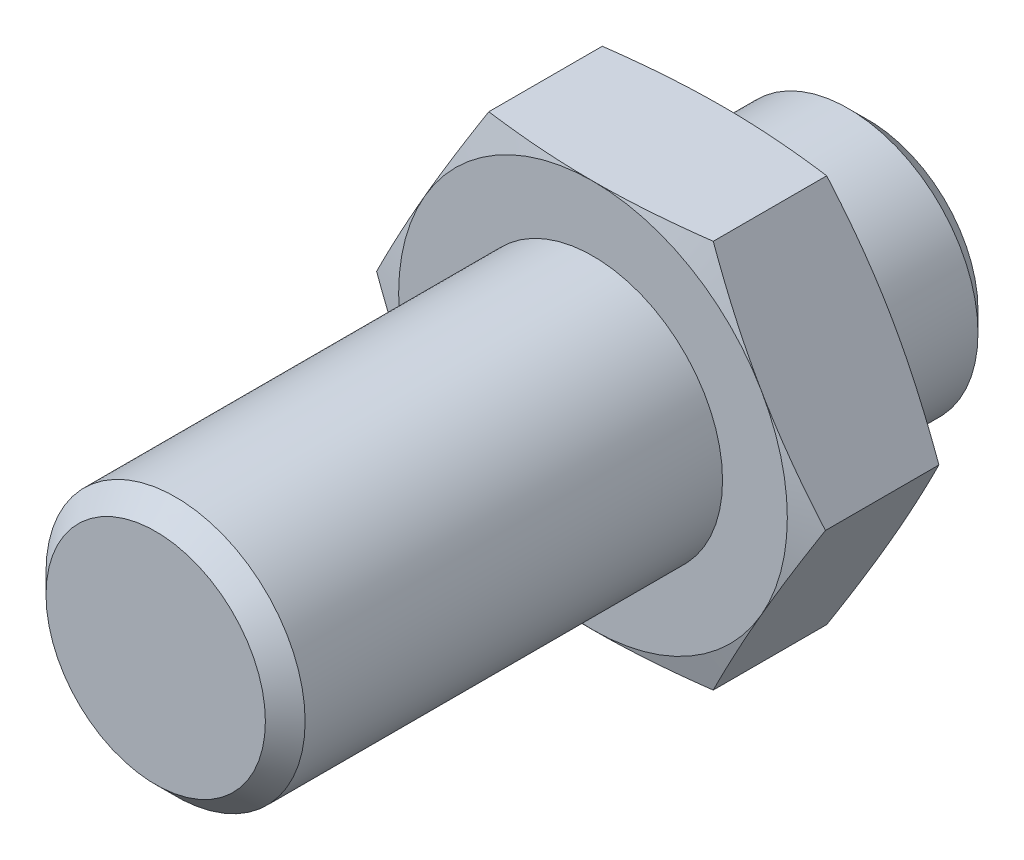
ISO-10303-21;
HEADER;
FILE_DESCRIPTION(('STEP AP214'),'2;1');
FILE_NAME('part.step','',(''),(''),'','','');
FILE_SCHEMA(('AUTOMOTIVE_DESIGN { 1 0 10303 214 1 1 1 1 }'));
ENDSEC;
DATA;
#1=APPLICATION_CONTEXT('core data for automotive mechanical design processes');
#2=APPLICATION_PROTOCOL_DEFINITION('international standard','automotive_design',2000,#1);
#3=PRODUCT_CONTEXT('',#1,'mechanical');
#4=PRODUCT('Part','Part','',(#3));
#5=PRODUCT_RELATED_PRODUCT_CATEGORY('part','',(#4));
#6=PRODUCT_DEFINITION_FORMATION('','',#4);
#7=PRODUCT_DEFINITION_CONTEXT('part definition',#1,'design');
#8=PRODUCT_DEFINITION('design','',#6,#7);
#9=PRODUCT_DEFINITION_SHAPE('','',#8);
#10=(LENGTH_UNIT() NAMED_UNIT(*) SI_UNIT(.MILLI.,.METRE.));
#11=(NAMED_UNIT(*) PLANE_ANGLE_UNIT() SI_UNIT($,.RADIAN.));
#12=(NAMED_UNIT(*) SI_UNIT($,.STERADIAN.) SOLID_ANGLE_UNIT());
#13=UNCERTAINTY_MEASURE_WITH_UNIT(LENGTH_MEASURE(1.E-05),#10,'distance_accuracy_value','');
#14=(GEOMETRIC_REPRESENTATION_CONTEXT(3) GLOBAL_UNCERTAINTY_ASSIGNED_CONTEXT((#13)) GLOBAL_UNIT_ASSIGNED_CONTEXT((#10,
#11,#12)) REPRESENTATION_CONTEXT('',''));
#15=CARTESIAN_POINT('',(0.,0.,0.));
#16=DIRECTION('',(0.,0.,1.));
#17=DIRECTION('',(1.,0.,0.));
#18=AXIS2_PLACEMENT_3D('',#15,#16,#17);
#19=CARTESIAN_POINT('',(0.,3.3865,0.));
#20=DIRECTION('',(0.,0.,1.));
#21=DIRECTION('',(1.,0.,0.));
#22=AXIS2_PLACEMENT_3D('',#19,#20,#21);
#23=PLANE('',#22);
#24=CARTESIAN_POINT('',(0.,0.,0.));
#25=DIRECTION('',(0.,0.,1.));
#26=DIRECTION('',(1.,0.,0.));
#27=AXIS2_PLACEMENT_3D('',#24,#25,#26);
#28=CIRCLE('',#27,3.38650000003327);
#29=CARTESIAN_POINT('',(3.38650000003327,0.,0.));
#30=VERTEX_POINT('',#29);
#31=EDGE_CURVE('E20',#30,#30,#28,.T.);
#32=ORIENTED_EDGE('',*,*,#31,.F.);
#33=EDGE_LOOP('',(#32));
#34=FACE_BOUND('',#33,.T.);
#35=ADVANCED_FACE('F17',(#34),#23,.F.);
#36=CARTESIAN_POINT('',(0.,0.,0.613499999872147));
#37=DIRECTION('',(0.,0.,1.));
#38=DIRECTION('',(1.,0.,0.));
#39=AXIS2_PLACEMENT_3D('',#36,#37,#38);
#40=CONICAL_SURFACE('',#39,3.99999999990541,0.785398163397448);
#41=CARTESIAN_POINT('',(0.,0.,0.613500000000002));
#42=DIRECTION('',(0.,0.,1.));
#43=DIRECTION('',(1.,0.,0.));
#44=AXIS2_PLACEMENT_3D('',#41,#42,#43);
#45=CIRCLE('',#44,4.);
#46=CARTESIAN_POINT('',(4.,0.,0.613500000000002));
#47=VERTEX_POINT('',#46);
#48=EDGE_CURVE('E371',#47,#47,#45,.T.);
#49=ORIENTED_EDGE('',*,*,#48,.F.);
#50=EDGE_LOOP('',(#49));
#51=FACE_BOUND('',#50,.T.);
#52=ORIENTED_EDGE('',*,*,#31,.T.);
#53=EDGE_LOOP('',(#52));
#54=FACE_BOUND('',#53,.T.);
#55=ADVANCED_FACE('F408',(#51,#54),#40,.T.);
#56=CARTESIAN_POINT('',(0.,0.,0.));
#57=DIRECTION('',(0.,0.,1.));
#58=DIRECTION('',(1.,0.,0.));
#59=AXIS2_PLACEMENT_3D('',#56,#57,#58);
#60=CYLINDRICAL_SURFACE('',#59,4.);
#61=CARTESIAN_POINT('',(0.,0.,4.5));
#62=DIRECTION('',(0.,0.,1.));
#63=DIRECTION('',(1.,0.,0.));
#64=AXIS2_PLACEMENT_3D('',#61,#62,#63);
#65=CIRCLE('',#64,4.);
#66=CARTESIAN_POINT('',(4.,0.,4.5));
#67=VERTEX_POINT('',#66);
#68=EDGE_CURVE('E125',#67,#67,#65,.F.);
#69=ORIENTED_EDGE('',*,*,#68,.T.);
#70=EDGE_LOOP('',(#69));
#71=FACE_BOUND('',#70,.T.);
#72=ORIENTED_EDGE('',*,*,#48,.T.);
#73=EDGE_LOOP('',(#72));
#74=FACE_BOUND('',#73,.T.);
#75=ADVANCED_FACE('F400',(#71,#74),#60,.T.);
#76=CARTESIAN_POINT('',(0.,4.,4.5));
#77=DIRECTION('',(0.,0.,1.));
#78=DIRECTION('',(1.,0.,0.));
#79=AXIS2_PLACEMENT_3D('',#76,#77,#78);
#80=PLANE('',#79);
#81=ORIENTED_EDGE('',*,*,#68,.F.);
#82=EDGE_LOOP('',(#81));
#83=FACE_BOUND('',#82,.T.);
#84=CARTESIAN_POINT('',(0.,0.,4.50000000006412));
#85=DIRECTION('',(0.,0.,1.));
#86=DIRECTION('',(1.,0.,0.));
#87=AXIS2_PLACEMENT_3D('',#84,#85,#86);
#88=CIRCLE('',#87,6.00000000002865);
#89=CARTESIAN_POINT('',(5.19615242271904,-3.00000000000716,4.50000000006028));
#90=VERTEX_POINT('',#89);
#91=CARTESIAN_POINT('',(5.19615242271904,3.00000000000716,4.50000000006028));
#92=VERTEX_POINT('',#91);
#93=EDGE_CURVE('E106',#90,#92,#88,.T.);
#94=ORIENTED_EDGE('',*,*,#93,.F.);
#95=CARTESIAN_POINT('',(0.,0.,4.50000000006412));
#96=DIRECTION('',(0.,0.,1.));
#97=DIRECTION('',(1.,0.,0.));
#98=AXIS2_PLACEMENT_3D('',#95,#96,#97);
#99=CIRCLE('',#98,6.00000000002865);
#100=CARTESIAN_POINT('',(0.,-6.00000000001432,4.50000000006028));
#101=VERTEX_POINT('',#100);
#102=EDGE_CURVE('E103',#101,#90,#99,.T.);
#103=ORIENTED_EDGE('',*,*,#102,.F.);
#104=CARTESIAN_POINT('',(0.,0.,4.50000000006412));
#105=DIRECTION('',(0.,0.,1.));
#106=DIRECTION('',(1.,0.,0.));
#107=AXIS2_PLACEMENT_3D('',#104,#105,#106);
#108=CIRCLE('',#107,6.00000000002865);
#109=CARTESIAN_POINT('',(-5.19615242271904,-3.00000000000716,4.50000000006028));
#110=VERTEX_POINT('',#109);
#111=EDGE_CURVE('E124',#110,#101,#108,.T.);
#112=ORIENTED_EDGE('',*,*,#111,.F.);
#113=CARTESIAN_POINT('',(0.,0.,4.50000000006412));
#114=DIRECTION('',(0.,0.,1.));
#115=DIRECTION('',(1.,0.,0.));
#116=AXIS2_PLACEMENT_3D('',#113,#114,#115);
#117=CIRCLE('',#116,6.00000000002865);
#118=CARTESIAN_POINT('',(-5.19615242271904,3.00000000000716,4.50000000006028));
#119=VERTEX_POINT('',#118);
#120=EDGE_CURVE('E393',#119,#110,#117,.T.);
#121=ORIENTED_EDGE('',*,*,#120,.F.);
#122=CARTESIAN_POINT('',(0.,0.,4.50000000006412));
#123=DIRECTION('',(0.,0.,1.));
#124=DIRECTION('',(1.,0.,0.));
#125=AXIS2_PLACEMENT_3D('',#122,#123,#124);
#126=CIRCLE('',#125,6.00000000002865);
#127=CARTESIAN_POINT('',(0.,6.00000000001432,4.50000000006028));
#128=VERTEX_POINT('',#127);
#129=EDGE_CURVE('E113',#128,#119,#126,.T.);
#130=ORIENTED_EDGE('',*,*,#129,.F.);
#131=CARTESIAN_POINT('',(0.,0.,4.50000000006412));
#132=DIRECTION('',(0.,0.,1.));
#133=DIRECTION('',(1.,0.,0.));
#134=AXIS2_PLACEMENT_3D('',#131,#132,#133);
#135=CIRCLE('',#134,6.00000000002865);
#136=EDGE_CURVE('E109',#92,#128,#135,.T.);
#137=ORIENTED_EDGE('',*,*,#136,.F.);
#138=EDGE_LOOP('',(#94,#103,#112,#121,#130,#137));
#139=FACE_BOUND('',#138,.T.);
#140=ADVANCED_FACE('F107',(#83,#139),#80,.F.);
#141=CARTESIAN_POINT('',(0.,0.,4.75020357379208));
#142=DIRECTION('',(0.,0.,1.));
#143=DIRECTION('',(1.,0.,0.));
#144=AXIS2_PLACEMENT_3D('',#141,#142,#143);
#145=CONICAL_SURFACE('',#144,6.93377244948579,1.30899693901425);
#146=CARTESIAN_POINT('',(0.,-6.,4.50000000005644));
#147=CARTESIAN_POINT('',(0.144925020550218,-6.,4.49999340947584));
#148=CARTESIAN_POINT('',(0.289845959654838,-6.,4.50140757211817));
#149=CARTESIAN_POINT('',(0.579629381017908,-6.,4.5070216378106));
#150=CARTESIAN_POINT('',(0.724491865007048,-6.,4.51122145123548));
#151=CARTESIAN_POINT('',(1.15859244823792,-6.,4.52790288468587));
#152=CARTESIAN_POINT('',(1.44768188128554,-6.,4.54446674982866));
#153=CARTESIAN_POINT('',(2.02502964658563,-6.,4.58746786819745));
#154=CARTESIAN_POINT('',(2.31328815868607,-6.,4.61390279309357));
#155=CARTESIAN_POINT('',(2.88923748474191,-6.,4.67527616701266));
#156=CARTESIAN_POINT('',(3.17692727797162,-6.,4.71022426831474));
#157=CARTESIAN_POINT('',(3.46410161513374,-6.,4.74871130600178));
#158=B_SPLINE_CURVE_WITH_KNOTS('',3,(#146,#147,#148,#149,#150,#151,#152,#153,#154,#155,#156,
#157),.UNSPECIFIED.,.F.,.F.,(4,2,2,2,2,4),(0.,0.434760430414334,0.869506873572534,
1.73798582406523,2.6062600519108,3.47552335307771),.UNSPECIFIED.);
#159=CARTESIAN_POINT('',(3.464101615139,-5.99999999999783,4.74871130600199));
#160=VERTEX_POINT('',#159);
#161=EDGE_CURVE('E122',#101,#160,#158,.T.);
#162=ORIENTED_EDGE('',*,*,#161,.F.);
#163=ORIENTED_EDGE('',*,*,#102,.T.);
#164=CARTESIAN_POINT('',(3.46410161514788,-6.00000000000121,4.74871130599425));
#165=CARTESIAN_POINT('',(3.60768878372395,-5.75129972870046,4.71022426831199));
#166=CARTESIAN_POINT('',(3.75153368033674,-5.5021530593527,4.67527616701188));
#167=CARTESIAN_POINT('',(4.03950834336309,-5.00336631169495,4.61390279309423));
#168=CARTESIAN_POINT('',(4.1836375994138,-4.75372711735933,4.5874678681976));
#169=CARTESIAN_POINT('',(4.47231148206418,-4.25372928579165,4.54446674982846));
#170=CARTESIAN_POINT('',(4.61685619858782,-4.00337049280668,4.52790288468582));
#171=CARTESIAN_POINT('',(4.83390649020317,-3.62742835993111,4.51122145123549));
#172=CARTESIAN_POINT('',(4.90633773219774,-3.50197376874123,4.5070216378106));
#173=CARTESIAN_POINT('',(5.05122944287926,-3.25101396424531,4.50140757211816));
#174=CARTESIAN_POINT('',(5.12368991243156,-3.12550874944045,4.49999340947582));
#175=CARTESIAN_POINT('',(5.19615242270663,-3.,4.50000000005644));
#176=B_SPLINE_CURVE_WITH_KNOTS('',3,(#164,#165,#166,#167,#168,#169,#170,#171,#172,#173,#174,
#175),.UNSPECIFIED.,.F.,.F.,(4,2,2,2,2,4),(0.,0.869263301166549,1.73753752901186,
2.60601647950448,3.04076292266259,3.47552335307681),.UNSPECIFIED.);
#177=EDGE_CURVE('E119',#160,#90,#176,.T.);
#178=ORIENTED_EDGE('',*,*,#177,.F.);
#179=EDGE_LOOP('',(#162,#163,#178));
#180=FACE_BOUND('',#179,.T.);
#181=ADVANCED_FACE('F117',(#180),#145,.T.);
#182=CARTESIAN_POINT('',(0.,0.,4.75020357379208));
#183=DIRECTION('',(0.,0.,1.));
#184=DIRECTION('',(1.,0.,0.));
#185=AXIS2_PLACEMENT_3D('',#182,#183,#184);
#186=CONICAL_SURFACE('',#185,6.93377244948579,1.30899693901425);
#187=CARTESIAN_POINT('',(-5.19615242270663,-3.,4.50000000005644));
#188=CARTESIAN_POINT('',(-5.12368991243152,-3.12550874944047,4.49999340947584));
#189=CARTESIAN_POINT('',(-5.05122944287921,-3.25101396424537,4.50140757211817));
#190=CARTESIAN_POINT('',(-4.90633773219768,-3.50197376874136,4.5070216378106));
#191=CARTESIAN_POINT('',(-4.83390649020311,-3.62742835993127,4.51122145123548));
#192=CARTESIAN_POINT('',(-4.61685619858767,-4.00337049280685,4.52790288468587));
#193=CARTESIAN_POINT('',(-4.47231148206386,-4.25372928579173,4.54446674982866));
#194=CARTESIAN_POINT('',(-4.18363759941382,-4.75372711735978,4.58746786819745));
#195=CARTESIAN_POINT('',(-4.03950834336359,-5.00336631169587,4.61390279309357));
#196=CARTESIAN_POINT('',(-3.75153368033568,-5.50215305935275,4.67527616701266));
#197=CARTESIAN_POINT('',(-3.60768878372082,-5.75129972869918,4.71022426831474));
#198=CARTESIAN_POINT('',(-3.46410161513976,-5.99999999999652,4.74871130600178));
#199=B_SPLINE_CURVE_WITH_KNOTS('',3,(#187,#188,#189,#190,#191,#192,#193,#194,#195,#196,#197,
#198),.UNSPECIFIED.,.F.,.F.,(4,2,2,2,2,4),(0.,0.434760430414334,0.869506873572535,
1.73798582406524,2.60626005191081,3.47552335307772),.UNSPECIFIED.);
#200=CARTESIAN_POINT('',(-3.46410161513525,-6.,4.74871130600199));
#201=VERTEX_POINT('',#200);
#202=EDGE_CURVE('E378',#110,#201,#199,.T.);
#203=ORIENTED_EDGE('',*,*,#202,.F.);
#204=ORIENTED_EDGE('',*,*,#111,.T.);
#205=CARTESIAN_POINT('',(-3.46410161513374,-6.00000000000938,4.74871130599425));
#206=CARTESIAN_POINT('',(-3.17692727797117,-6.00000000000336,4.71022426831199));
#207=CARTESIAN_POINT('',(-2.88923748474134,-6.0000000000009,4.67527616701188));
#208=CARTESIAN_POINT('',(-2.31328815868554,-5.9999999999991,4.61390279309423));
#209=CARTESIAN_POINT('',(-2.02502964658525,-5.99999999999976,4.5874678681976));
#210=CARTESIAN_POINT('',(-1.44768188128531,-6.00000000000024,4.54446674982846));
#211=CARTESIAN_POINT('',(-1.1585924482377,-6.00000000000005,4.52790288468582));
#212=CARTESIAN_POINT('',(-0.724491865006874,-5.99999999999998,4.51122145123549));
#213=CARTESIAN_POINT('',(-0.579629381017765,-5.99999999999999,4.5070216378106));
#214=CARTESIAN_POINT('',(-0.289845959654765,-6.00000000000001,4.50140757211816));
#215=CARTESIAN_POINT('',(-0.144925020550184,-6.00000000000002,4.49999340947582));
#216=CARTESIAN_POINT('',(0.,-6.,4.50000000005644));
#217=B_SPLINE_CURVE_WITH_KNOTS('',3,(#205,#206,#207,#208,#209,#210,#211,#212,#213,#214,#215,
#216),.UNSPECIFIED.,.F.,.F.,(4,2,2,2,2,4),(0.,0.869263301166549,1.73753752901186,
2.60601647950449,3.0407629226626,3.47552335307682),.UNSPECIFIED.);
#218=EDGE_CURVE('E134',#201,#101,#217,.T.);
#219=ORIENTED_EDGE('',*,*,#218,.F.);
#220=EDGE_LOOP('',(#203,#204,#219));
#221=FACE_BOUND('',#220,.T.);
#222=ADVANCED_FACE('F158',(#221),#186,.T.);
#223=CARTESIAN_POINT('',(0.,0.,4.75020357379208));
#224=DIRECTION('',(0.,0.,1.));
#225=DIRECTION('',(1.,0.,0.));
#226=AXIS2_PLACEMENT_3D('',#223,#224,#225);
#227=CONICAL_SURFACE('',#226,6.93377244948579,1.30899693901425);
#228=ORIENTED_EDGE('',*,*,#120,.T.);
#229=CARTESIAN_POINT('',(-6.92820323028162,-8.16341725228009E-12,4.74871130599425));
#230=CARTESIAN_POINT('',(-6.78461606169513,-0.248700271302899,4.71022426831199));
#231=CARTESIAN_POINT('',(-6.64077116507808,-0.497846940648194,4.67527616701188));
#232=CARTESIAN_POINT('',(-6.35279650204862,-0.996633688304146,4.61390279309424));
#233=CARTESIAN_POINT('',(-6.20866724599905,-1.24627288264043,4.5874678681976));
#234=CARTESIAN_POINT('',(-5.91999336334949,-1.74627071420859,4.54446674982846));
#235=CARTESIAN_POINT('',(-5.77544864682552,-1.99662950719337,4.52790288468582));
#236=CARTESIAN_POINT('',(-5.55839835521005,-2.37257164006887,4.51122145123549));
#237=CARTESIAN_POINT('',(-5.48596711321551,-2.49802623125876,4.5070216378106));
#238=CARTESIAN_POINT('',(-5.34107540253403,-2.7489860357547,4.50140757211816));
#239=CARTESIAN_POINT('',(-5.26861493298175,-2.87449125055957,4.49999340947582));
#240=CARTESIAN_POINT('',(-5.19615242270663,-3.,4.50000000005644));
#241=B_SPLINE_CURVE_WITH_KNOTS('',3,(#229,#230,#231,#232,#233,#234,#235,#236,#237,#238,#239,
#240),.UNSPECIFIED.,.F.,.F.,(4,2,2,2,2,4),(0.,0.869263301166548,1.73753752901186,
2.60601647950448,3.04076292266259,3.47552335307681),.UNSPECIFIED.);
#242=CARTESIAN_POINT('',(-6.92820323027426,-2.16671186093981E-12,4.74871130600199));
#243=VERTEX_POINT('',#242);
#244=EDGE_CURVE('E168',#243,#110,#241,.T.);
#245=ORIENTED_EDGE('',*,*,#244,.F.);
#246=CARTESIAN_POINT('',(-5.19615242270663,3.,4.50000000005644));
#247=CARTESIAN_POINT('',(-5.26861493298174,2.87449125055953,4.49999340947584));
#248=CARTESIAN_POINT('',(-5.34107540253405,2.74898603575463,4.50140757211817));
#249=CARTESIAN_POINT('',(-5.48596711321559,2.49802623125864,4.5070216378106));
#250=CARTESIAN_POINT('',(-5.55839835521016,2.37257164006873,4.51122145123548));
#251=CARTESIAN_POINT('',(-5.77544864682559,1.99662950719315,4.52790288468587));
#252=CARTESIAN_POINT('',(-5.9199933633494,1.74627071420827,4.54446674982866));
#253=CARTESIAN_POINT('',(-6.20866724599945,1.24627288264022,4.58746786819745));
#254=CARTESIAN_POINT('',(-6.35279650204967,0.996633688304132,4.61390279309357));
#255=CARTESIAN_POINT('',(-6.64077116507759,0.497846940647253,4.67527616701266));
#256=CARTESIAN_POINT('',(-6.78461606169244,0.248700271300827,4.71022426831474));
#257=CARTESIAN_POINT('',(-6.9282032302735,3.47812675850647E-12,4.74871130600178));
#258=B_SPLINE_CURVE_WITH_KNOTS('',3,(#246,#247,#248,#249,#250,#251,#252,#253,#254,#255,#256,
#257),.UNSPECIFIED.,.F.,.F.,(4,2,2,2,2,4),(0.,0.434760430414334,0.869506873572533,
1.73798582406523,2.6062600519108,3.47552335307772),.UNSPECIFIED.);
#259=EDGE_CURVE('E267',#119,#243,#258,.T.);
#260=ORIENTED_EDGE('',*,*,#259,.F.);
#261=EDGE_LOOP('',(#228,#245,#260));
#262=FACE_BOUND('',#261,.T.);
#263=ADVANCED_FACE('F501',(#262),#227,.T.);
#264=CARTESIAN_POINT('',(0.,0.,4.75020357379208));
#265=DIRECTION('',(0.,0.,1.));
#266=DIRECTION('',(1.,0.,0.));
#267=AXIS2_PLACEMENT_3D('',#264,#265,#266);
#268=CONICAL_SURFACE('',#267,6.93377244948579,1.30899693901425);
#269=ORIENTED_EDGE('',*,*,#129,.T.);
#270=CARTESIAN_POINT('',(-3.46410161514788,6.00000000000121,4.74871130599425));
#271=CARTESIAN_POINT('',(-3.60768878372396,5.75129972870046,4.71022426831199));
#272=CARTESIAN_POINT('',(-3.75153368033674,5.5021530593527,4.67527616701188));
#273=CARTESIAN_POINT('',(-4.03950834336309,5.00336631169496,4.61390279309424));
#274=CARTESIAN_POINT('',(-4.1836375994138,4.75372711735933,4.5874678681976));
#275=CARTESIAN_POINT('',(-4.47231148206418,4.25372928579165,4.54446674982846));
#276=CARTESIAN_POINT('',(-4.61685619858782,4.00337049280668,4.52790288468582));
#277=CARTESIAN_POINT('',(-4.83390649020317,3.62742835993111,4.51122145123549));
#278=CARTESIAN_POINT('',(-4.90633773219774,3.50197376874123,4.5070216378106));
#279=CARTESIAN_POINT('',(-5.05122944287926,3.25101396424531,4.50140757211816));
#280=CARTESIAN_POINT('',(-5.12368991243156,3.12550874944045,4.49999340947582));
#281=CARTESIAN_POINT('',(-5.19615242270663,3.,4.50000000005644));
#282=B_SPLINE_CURVE_WITH_KNOTS('',3,(#270,#271,#272,#273,#274,#275,#276,#277,#278,#279,#280,
#281),.UNSPECIFIED.,.F.,.F.,(4,2,2,2,2,4),(0.,0.869263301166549,1.73753752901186,
2.60601647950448,3.04076292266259,3.47552335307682),.UNSPECIFIED.);
#283=CARTESIAN_POINT('',(-3.464101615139,5.99999999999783,4.74871130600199));
#284=VERTEX_POINT('',#283);
#285=EDGE_CURVE('E377',#284,#119,#282,.T.);
#286=ORIENTED_EDGE('',*,*,#285,.F.);
#287=CARTESIAN_POINT('',(0.,6.,4.50000000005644));
#288=CARTESIAN_POINT('',(-0.144925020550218,6.,4.49999340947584));
#289=CARTESIAN_POINT('',(-0.289845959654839,6.,4.50140757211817));
#290=CARTESIAN_POINT('',(-0.579629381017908,6.,4.5070216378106));
#291=CARTESIAN_POINT('',(-0.724491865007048,6.,4.51122145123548));
#292=CARTESIAN_POINT('',(-1.15859244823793,6.,4.52790288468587));
#293=CARTESIAN_POINT('',(-1.44768188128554,6.,4.54446674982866));
#294=CARTESIAN_POINT('',(-2.02502964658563,6.,4.58746786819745));
#295=CARTESIAN_POINT('',(-2.31328815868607,6.,4.61390279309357));
#296=CARTESIAN_POINT('',(-2.88923748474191,6.,4.67527616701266));
#297=CARTESIAN_POINT('',(-3.17692727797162,6.,4.71022426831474));
#298=CARTESIAN_POINT('',(-3.46410161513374,6.,4.74871130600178));
#299=B_SPLINE_CURVE_WITH_KNOTS('',3,(#287,#288,#289,#290,#291,#292,#293,#294,#295,#296,#297,
#298),.UNSPECIFIED.,.F.,.F.,(4,2,2,2,2,4),(0.,0.434760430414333,0.869506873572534,
1.73798582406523,2.6062600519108,3.47552335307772),.UNSPECIFIED.);
#300=EDGE_CURVE('E262',#128,#284,#299,.T.);
#301=ORIENTED_EDGE('',*,*,#300,.F.);
#302=EDGE_LOOP('',(#269,#286,#301));
#303=FACE_BOUND('',#302,.T.);
#304=ADVANCED_FACE('F495',(#303),#268,.T.);
#305=CARTESIAN_POINT('',(0.,0.,4.75020357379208));
#306=DIRECTION('',(0.,0.,1.));
#307=DIRECTION('',(1.,0.,0.));
#308=AXIS2_PLACEMENT_3D('',#305,#306,#307);
#309=CONICAL_SURFACE('',#308,6.93377244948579,1.30899693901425);
#310=ORIENTED_EDGE('',*,*,#93,.T.);
#311=CARTESIAN_POINT('',(6.92820323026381,1.27161662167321E-11,4.74871130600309));
#312=CARTESIAN_POINT('',(6.78461606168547,0.248700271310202,4.71022426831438));
#313=CARTESIAN_POINT('',(6.64077116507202,0.497846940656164,4.67527616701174));
#314=CARTESIAN_POINT('',(6.35279650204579,0.996633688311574,4.61390279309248));
#315=CARTESIAN_POINT('',(6.20866724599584,1.24627288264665,4.58746786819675));
#316=CARTESIAN_POINT('',(5.91999336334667,1.74627071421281,4.54446674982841));
#317=CARTESIAN_POINT('',(5.77544864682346,1.9966295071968,4.52790288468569));
#318=CARTESIAN_POINT('',(5.55839835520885,2.37257164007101,4.51122145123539));
#319=CARTESIAN_POINT('',(5.48596711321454,2.49802623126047,4.50702163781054));
#320=CARTESIAN_POINT('',(5.34107540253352,2.74898603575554,4.50140757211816));
#321=CARTESIAN_POINT('',(5.26861493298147,2.87449125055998,4.49999340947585));
#322=CARTESIAN_POINT('',(5.19615242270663,3.,4.50000000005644));
#323=B_SPLINE_CURVE_WITH_KNOTS('',3,(#311,#312,#313,#314,#315,#316,#317,#318,#319,#320,#321,
#322),.UNSPECIFIED.,.F.,.F.,(4,2,2,2,2,4),(0.,0.869263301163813,1.73753752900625,
2.60601647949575,3.04076292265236,3.47552335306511),.UNSPECIFIED.);
#324=CARTESIAN_POINT('',(6.92820323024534,0.,4.74871130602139));
#325=VERTEX_POINT('',#324);
#326=EDGE_CURVE('E131',#325,#92,#323,.T.);
#327=ORIENTED_EDGE('',*,*,#326,.F.);
#328=CARTESIAN_POINT('',(5.19615242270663,-3.,4.50000000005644));
#329=CARTESIAN_POINT('',(5.26861493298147,-2.87449125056,4.49999340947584));
#330=CARTESIAN_POINT('',(5.34107540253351,-2.74898603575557,4.50140757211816));
#331=CARTESIAN_POINT('',(5.4859671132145,-2.49802623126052,4.50702163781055));
#332=CARTESIAN_POINT('',(5.5583983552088,-2.37257164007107,4.51122145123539));
#333=CARTESIAN_POINT('',(5.77544864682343,-1.99662950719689,4.52790288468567));
#334=CARTESIAN_POINT('',(5.91999336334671,-1.74627071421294,4.54446674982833));
#335=CARTESIAN_POINT('',(6.20866724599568,-1.24627288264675,4.58746786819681));
#336=CARTESIAN_POINT('',(6.35279650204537,-0.996633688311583,4.61390279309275));
#337=CARTESIAN_POINT('',(6.64077116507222,-0.497846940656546,4.67527616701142));
#338=CARTESIAN_POINT('',(6.78461606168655,-0.248700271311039,4.71022426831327));
#339=CARTESIAN_POINT('',(6.92820323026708,-1.46054919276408E-11,4.74871130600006));
#340=B_SPLINE_CURVE_WITH_KNOTS('',3,(#328,#329,#330,#331,#332,#333,#334,#335,#336,#337,#338,
#339),.UNSPECIFIED.,.F.,.F.,(4,2,2,2,2,4),(0.,0.43476043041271,0.869506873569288,
1.73798582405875,2.60626005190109,3.47552335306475),.UNSPECIFIED.);
#341=EDGE_CURVE('E128',#90,#325,#340,.T.);
#342=ORIENTED_EDGE('',*,*,#341,.F.);
#343=EDGE_LOOP('',(#310,#327,#342));
#344=FACE_BOUND('',#343,.T.);
#345=ADVANCED_FACE('F129',(#344),#309,.T.);
#346=CARTESIAN_POINT('',(0.,0.,4.75020357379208));
#347=DIRECTION('',(0.,0.,1.));
#348=DIRECTION('',(1.,0.,0.));
#349=AXIS2_PLACEMENT_3D('',#346,#347,#348);
#350=CONICAL_SURFACE('',#349,6.93377244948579,1.30899693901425);
#351=ORIENTED_EDGE('',*,*,#136,.T.);
#352=CARTESIAN_POINT('',(3.46410161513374,6.00000000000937,4.74871130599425));
#353=CARTESIAN_POINT('',(3.17692727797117,6.00000000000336,4.71022426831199));
#354=CARTESIAN_POINT('',(2.88923748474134,6.0000000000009,4.67527616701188));
#355=CARTESIAN_POINT('',(2.31328815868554,5.9999999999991,4.61390279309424));
#356=CARTESIAN_POINT('',(2.02502964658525,5.99999999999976,4.5874678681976));
#357=CARTESIAN_POINT('',(1.44768188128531,6.00000000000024,4.54446674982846));
#358=CARTESIAN_POINT('',(1.1585924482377,6.00000000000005,4.52790288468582));
#359=CARTESIAN_POINT('',(0.724491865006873,5.99999999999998,4.51122145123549));
#360=CARTESIAN_POINT('',(0.579629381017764,5.99999999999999,4.5070216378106));
#361=CARTESIAN_POINT('',(0.289845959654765,6.00000000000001,4.50140757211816));
#362=CARTESIAN_POINT('',(0.144925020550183,6.00000000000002,4.49999340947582));
#363=CARTESIAN_POINT('',(0.,6.,4.50000000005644));
#364=B_SPLINE_CURVE_WITH_KNOTS('',3,(#352,#353,#354,#355,#356,#357,#358,#359,#360,#361,#362,
#363),.UNSPECIFIED.,.F.,.F.,(4,2,2,2,2,4),(0.,0.869263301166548,1.73753752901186,
2.60601647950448,3.0407629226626,3.47552335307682),.UNSPECIFIED.);
#365=CARTESIAN_POINT('',(3.46410161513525,6.,4.74871130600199));
#366=VERTEX_POINT('',#365);
#367=EDGE_CURVE('E256',#366,#128,#364,.T.);
#368=ORIENTED_EDGE('',*,*,#367,.F.);
#369=CARTESIAN_POINT('',(5.19615242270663,3.,4.50000000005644));
#370=CARTESIAN_POINT('',(5.12368991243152,3.12550874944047,4.49999340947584));
#371=CARTESIAN_POINT('',(5.05122944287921,3.25101396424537,4.50140757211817));
#372=CARTESIAN_POINT('',(4.90633773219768,3.50197376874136,4.5070216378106));
#373=CARTESIAN_POINT('',(4.83390649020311,3.62742835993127,4.51122145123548));
#374=CARTESIAN_POINT('',(4.61685619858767,4.00337049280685,4.52790288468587));
#375=CARTESIAN_POINT('',(4.47231148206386,4.25372928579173,4.54446674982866));
#376=CARTESIAN_POINT('',(4.18363759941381,4.75372711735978,4.58746786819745));
#377=CARTESIAN_POINT('',(4.03950834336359,5.00336631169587,4.61390279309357));
#378=CARTESIAN_POINT('',(3.75153368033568,5.50215305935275,4.67527616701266));
#379=CARTESIAN_POINT('',(3.60768878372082,5.75129972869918,4.71022426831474));
#380=CARTESIAN_POINT('',(3.46410161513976,5.99999999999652,4.74871130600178));
#381=B_SPLINE_CURVE_WITH_KNOTS('',3,(#369,#370,#371,#372,#373,#374,#375,#376,#377,#378,#379,
#380),.UNSPECIFIED.,.F.,.F.,(4,2,2,2,2,4),(0.,0.434760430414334,0.869506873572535,
1.73798582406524,2.60626005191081,3.47552335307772),.UNSPECIFIED.);
#382=EDGE_CURVE('E237',#92,#366,#381,.T.);
#383=ORIENTED_EDGE('',*,*,#382,.F.);
#384=EDGE_LOOP('',(#351,#368,#383));
#385=FACE_BOUND('',#384,.T.);
#386=ADVANCED_FACE('F248',(#385),#350,.T.);
#387=CARTESIAN_POINT('',(3.46410161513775,-6.,4.5));
#388=DIRECTION('',(0.866025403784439,-0.5,0.));
#389=DIRECTION('',(0.5,0.866025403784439,0.));
#390=AXIS2_PLACEMENT_3D('',#387,#388,#389);
#391=PLANE('',#390);
#392=CARTESIAN_POINT('',(3.46410166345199,-5.99999991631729,8.25128870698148));
#393=CARTESIAN_POINT('',(3.60768882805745,-5.75129965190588,8.28977574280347));
#394=CARTESIAN_POINT('',(3.75153372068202,-5.50215298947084,8.32472384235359));
#395=CARTESIAN_POINT('',(4.03950837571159,-5.0033662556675,8.38609721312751));
#396=CARTESIAN_POINT('',(4.18363762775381,-4.75372706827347,8.4125321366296));
#397=CARTESIAN_POINT('',(4.4723115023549,-4.25372925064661,8.4555332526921));
#398=CARTESIAN_POINT('',(4.61685621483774,-4.0033704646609,8.47209711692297));
#399=CARTESIAN_POINT('',(4.83390650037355,-3.62742834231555,8.48877854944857));
#400=CARTESIAN_POINT('',(4.9063377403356,-3.50197375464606,8.49297836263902));
#401=CARTESIAN_POINT('',(5.05122944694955,-3.25101395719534,8.49859242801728));
#402=CARTESIAN_POINT('',(5.12368991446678,-3.1255087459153,8.50000659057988));
#403=CARTESIAN_POINT('',(5.19615242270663,-3.,8.5));
#404=B_SPLINE_CURVE_WITH_KNOTS('',3,(#392,#393,#394,#395,#396,#397,#398,#399,#400,#401,#402,
#403),.UNSPECIFIED.,.F.,.F.,(4,2,2,2,2,4),(0.,0.869263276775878,1.73753748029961,
2.60601640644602,3.04076283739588,3.47552325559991),.UNSPECIFIED.);
#405=CARTESIAN_POINT('',(3.46410163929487,-5.99999995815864,8.2512887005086));
#406=VERTEX_POINT('',#405);
#407=CARTESIAN_POINT('',(5.19615242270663,-3.,8.5));
#408=VERTEX_POINT('',#407);
#409=EDGE_CURVE('E202',#406,#408,#404,.T.);
#410=ORIENTED_EDGE('',*,*,#409,.F.);
#411=DIRECTION('',(0.,0.,-1.));
#412=VECTOR('',#411,1.);
#413=CARTESIAN_POINT('',(3.46410161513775,-6.,4.5));
#414=LINE('',#413,#412);
#415=EDGE_CURVE('E138',#160,#406,#414,.F.);
#416=ORIENTED_EDGE('',*,*,#415,.F.);
#417=ORIENTED_EDGE('',*,*,#177,.T.);
#418=ORIENTED_EDGE('',*,*,#341,.T.);
#419=DIRECTION('',(0.,0.,1.));
#420=VECTOR('',#419,1.);
#421=CARTESIAN_POINT('',(6.92820323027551,0.,4.5));
#422=LINE('',#421,#420);
#423=CARTESIAN_POINT('',(6.92820320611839,4.18413613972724E-08,8.2512887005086));
#424=VERTEX_POINT('',#423);
#425=EDGE_CURVE('E236',#424,#325,#422,.F.);
#426=ORIENTED_EDGE('',*,*,#425,.F.);
#427=CARTESIAN_POINT('',(5.19615242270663,-3.,8.5));
#428=CARTESIAN_POINT('',(5.26861493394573,-2.87449124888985,8.50000659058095));
#429=CARTESIAN_POINT('',(5.34107540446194,-2.74898603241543,8.4985924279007));
#430=CARTESIAN_POINT('',(5.48596711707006,-2.4980262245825,8.49297836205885));
#431=CARTESIAN_POINT('',(5.55839836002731,-2.37257163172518,8.48877854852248));
#432=CARTESIAN_POINT('',(5.77544865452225,-1.99662949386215,8.47209711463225));
#433=CARTESIAN_POINT('',(5.91999337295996,-1.7462706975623,8.45553324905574));
#434=CARTESIAN_POINT('',(6.20866725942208,-1.24627285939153,8.41253212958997));
#435=CARTESIAN_POINT('',(6.3527965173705,-0.99663366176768,8.38609720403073));
#436=CARTESIAN_POINT('',(6.64077118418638,-0.497846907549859,8.32472382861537));
#437=CARTESIAN_POINT('',(6.78461608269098,-0.248700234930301,8.28977572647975));
#438=CARTESIAN_POINT('',(6.92820325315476,3.96280321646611E-08,8.25128868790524));
#439=B_SPLINE_CURVE_WITH_KNOTS('',3,(#427,#428,#429,#430,#431,#432,#433,#434,#435,#436,#437,
#438),.UNSPECIFIED.,.F.,.F.,(4,2,2,2,2,4),(0.,0.434760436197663,0.869506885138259,
1.73798584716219,2.60626008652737,3.47552339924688),.UNSPECIFIED.);
#440=EDGE_CURVE('E225',#408,#424,#439,.T.);
#441=ORIENTED_EDGE('',*,*,#440,.F.);
#442=EDGE_LOOP('',(#410,#416,#417,#418,#426,#441));
#443=FACE_BOUND('',#442,.T.);
#444=ADVANCED_FACE('F136',(#443),#391,.T.);
#445=CARTESIAN_POINT('',(-3.46410161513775,-6.,4.5));
#446=DIRECTION('',(0.,-1.,0.));
#447=DIRECTION('',(0.,0.,-1.));
#448=AXIS2_PLACEMENT_3D('',#445,#446,#447);
#449=PLANE('',#448);
#450=CARTESIAN_POINT('',(-3.46410151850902,-6.,8.25128870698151));
#451=CARTESIAN_POINT('',(-3.17692718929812,-6.,8.2897757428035));
#452=CARTESIAN_POINT('',(-2.88923740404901,-6.,8.32472384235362));
#453=CARTESIAN_POINT('',(-2.31328809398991,-6.,8.38609721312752));
#454=CARTESIAN_POINT('',(-2.02502958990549,-6.,8.41253213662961));
#455=CARTESIAN_POINT('',(-1.44768184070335,-6.,8.45553325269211));
#456=CARTESIAN_POINT('',(-1.15859241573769,-6.,8.47209711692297));
#457=CARTESIAN_POINT('',(-0.724491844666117,-6.,8.48877854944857));
#458=CARTESIAN_POINT('',(-0.579629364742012,-6.,8.49297836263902));
#459=CARTESIAN_POINT('',(-0.289845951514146,-6.,8.49859242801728));
#460=CARTESIAN_POINT('',(-0.144925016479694,-6.,8.50000659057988));
#461=CARTESIAN_POINT('',(0.,-6.,8.5));
#462=B_SPLINE_CURVE_WITH_KNOTS('',3,(#450,#451,#452,#453,#454,#455,#456,#457,#458,#459,#460,
#461),.UNSPECIFIED.,.F.,.F.,(4,2,2,2,2,4),(0.,0.869263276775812,1.73753748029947,
2.60601640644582,3.04076283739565,3.47552325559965),.UNSPECIFIED.);
#463=CARTESIAN_POINT('',(-3.46410156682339,-6.,8.25128870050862));
#464=VERTEX_POINT('',#463);
#465=CARTESIAN_POINT('',(0.,-6.,8.5));
#466=VERTEX_POINT('',#465);
#467=EDGE_CURVE('E188',#464,#466,#462,.T.);
#468=ORIENTED_EDGE('',*,*,#467,.F.);
#469=DIRECTION('',(0.,0.,1.));
#470=VECTOR('',#469,1.);
#471=CARTESIAN_POINT('',(-3.46410161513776,-6.,4.5));
#472=LINE('',#471,#470);
#473=EDGE_CURVE('E375',#201,#464,#472,.T.);
#474=ORIENTED_EDGE('',*,*,#473,.F.);
#475=ORIENTED_EDGE('',*,*,#218,.T.);
#476=ORIENTED_EDGE('',*,*,#161,.T.);
#477=ORIENTED_EDGE('',*,*,#415,.T.);
#478=CARTESIAN_POINT('',(0.,-6.,8.5));
#479=CARTESIAN_POINT('',(0.144925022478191,-6.,8.50000659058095));
#480=CARTESIAN_POINT('',(0.289845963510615,-6.,8.4985924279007));
#481=CARTESIAN_POINT('',(0.579629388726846,-6.,8.49297836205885));
#482=CARTESIAN_POINT('',(0.724491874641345,-6.,8.48877854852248));
#483=CARTESIAN_POINT('',(1.15859246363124,-6.,8.47209711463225));
#484=CARTESIAN_POINT('',(1.44768190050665,-6.,8.45553324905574));
#485=CARTESIAN_POINT('',(2.0250296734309,-6.,8.41253212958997));
#486=CARTESIAN_POINT('',(2.31328818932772,-6.,8.38609720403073));
#487=CARTESIAN_POINT('',(2.88923752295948,-6.,8.32472382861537));
#488=CARTESIAN_POINT('',(3.17692731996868,-6.,8.28977572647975));
#489=CARTESIAN_POINT('',(3.46410166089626,-6.,8.25128868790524));
#490=B_SPLINE_CURVE_WITH_KNOTS('',3,(#478,#479,#480,#481,#482,#483,#484,#485,#486,#487,#488,
#489),.UNSPECIFIED.,.F.,.F.,(4,2,2,2,2,4),(0.,0.434760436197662,0.869506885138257,
1.73798584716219,2.60626008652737,3.47552339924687),.UNSPECIFIED.);
#491=EDGE_CURVE('E195',#466,#406,#490,.T.);
#492=ORIENTED_EDGE('',*,*,#491,.F.);
#493=EDGE_LOOP('',(#468,#474,#475,#476,#477,#492));
#494=FACE_BOUND('',#493,.T.);
#495=ADVANCED_FACE('F177',(#494),#449,.T.);
#496=CARTESIAN_POINT('',(-6.92820323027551,0.,4.5));
#497=DIRECTION('',(-0.866025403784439,-0.5,0.));
#498=DIRECTION('',(0.5,-0.866025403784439,0.));
#499=AXIS2_PLACEMENT_3D('',#496,#497,#498);
#500=PLANE('',#499);
#501=CARTESIAN_POINT('',(-6.92820323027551,0.,8.25128869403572));
#502=CARTESIAN_POINT('',(-6.7846160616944,-0.248700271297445,8.28977573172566));
#503=CARTESIAN_POINT('',(-6.64077116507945,-0.497846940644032,8.32472383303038));
#504=CARTESIAN_POINT('',(-6.3527965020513,-0.996633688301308,8.38609720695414));
#505=CARTESIAN_POINT('',(-6.20866724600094,-1.24627288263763,8.41253213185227));
#506=CARTESIAN_POINT('',(-5.91999336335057,-1.74627071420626,8.45553325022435));
#507=CARTESIAN_POINT('',(-5.77544864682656,-1.99662950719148,8.47209711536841));
#508=CARTESIAN_POINT('',(-5.55839835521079,-2.37257164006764,8.4887785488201));
#509=CARTESIAN_POINT('',(-5.48596711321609,-2.49802623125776,8.4929783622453));
#510=CARTESIAN_POINT('',(-5.34107540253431,-2.74898603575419,8.49859242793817));
#511=CARTESIAN_POINT('',(-5.26861493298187,-2.87449125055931,8.50000659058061));
#512=CARTESIAN_POINT('',(-5.19615242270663,-3.,8.5));
#513=B_SPLINE_CURVE_WITH_KNOTS('',3,(#501,#502,#503,#504,#505,#506,#507,#508,#509,#510,#511,
#512),.UNSPECIFIED.,.F.,.F.,(4,2,2,2,2,4),(0.,0.869263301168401,1.73753752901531,
2.60601647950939,3.04076292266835,3.47552335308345),.UNSPECIFIED.);
#514=CARTESIAN_POINT('',(-6.92820323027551,0.,8.25128869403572));
#515=VERTEX_POINT('',#514);
#516=CARTESIAN_POINT('',(-5.19615242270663,-3.,8.5));
#517=VERTEX_POINT('',#516);
#518=EDGE_CURVE('E316',#515,#517,#513,.T.);
#519=ORIENTED_EDGE('',*,*,#518,.F.);
#520=DIRECTION('',(0.,0.,1.));
#521=VECTOR('',#520,1.);
#522=CARTESIAN_POINT('',(-6.92820323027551,0.,4.5));
#523=LINE('',#522,#521);
#524=EDGE_CURVE('E263',#243,#515,#523,.T.);
#525=ORIENTED_EDGE('',*,*,#524,.F.);
#526=ORIENTED_EDGE('',*,*,#244,.T.);
#527=ORIENTED_EDGE('',*,*,#202,.T.);
#528=ORIENTED_EDGE('',*,*,#473,.T.);
#529=CARTESIAN_POINT('',(-5.19615242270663,-3.,8.5));
#530=CARTESIAN_POINT('',(-5.12368991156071,-3.12550875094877,8.50000659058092));
#531=CARTESIAN_POINT('',(-5.05122944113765,-3.25101396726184,8.49859242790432));
#532=CARTESIAN_POINT('',(-4.90633772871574,-3.50197377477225,8.49297836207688));
#533=CARTESIAN_POINT('',(-4.83390648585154,-3.62742836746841,8.48877854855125));
#534=CARTESIAN_POINT('',(-4.6168561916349,-4.00337050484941,8.47209711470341));
#535=CARTESIAN_POINT('',(-4.47231147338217,-4.25372930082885,8.4555332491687));
#536=CARTESIAN_POINT('',(-4.1836375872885,-4.75372713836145,8.41253212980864));
#537=CARTESIAN_POINT('',(-4.03950832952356,-5.00336633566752,8.38609720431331));
#538=CARTESIAN_POINT('',(-3.75153366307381,-5.50215308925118,8.32472382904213));
#539=CARTESIAN_POINT('',(-3.60768876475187,-5.75129976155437,8.28977572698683));
#540=CARTESIAN_POINT('',(-3.46410159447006,-6.0000000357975,8.25128868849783));
#541=B_SPLINE_CURVE_WITH_KNOTS('',3,(#529,#530,#531,#532,#533,#534,#535,#536,#537,#538,#539,
#540),.UNSPECIFIED.,.F.,.F.,(4,2,2,2,2,4),(0.,0.434760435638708,0.869506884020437,
1.73798584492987,2.60626008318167,3.47552339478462),.UNSPECIFIED.);
#542=EDGE_CURVE('E321',#517,#464,#541,.T.);
#543=ORIENTED_EDGE('',*,*,#542,.F.);
#544=EDGE_LOOP('',(#519,#525,#526,#527,#528,#543));
#545=FACE_BOUND('',#544,.T.);
#546=ADVANCED_FACE('F180',(#545),#500,.T.);
#547=CARTESIAN_POINT('',(-3.46410161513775,6.,4.5));
#548=DIRECTION('',(-0.866025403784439,0.5,0.));
#549=DIRECTION('',(-0.5,-0.866025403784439,0.));
#550=AXIS2_PLACEMENT_3D('',#547,#548,#549);
#551=PLANE('',#550);
#552=CARTESIAN_POINT('',(-3.46410166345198,5.9999999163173,8.25128870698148));
#553=CARTESIAN_POINT('',(-3.60768882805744,5.75129965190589,8.28977574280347));
#554=CARTESIAN_POINT('',(-3.75153372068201,5.50215298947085,8.32472384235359));
#555=CARTESIAN_POINT('',(-4.03950837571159,5.0033662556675,8.38609721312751));
#556=CARTESIAN_POINT('',(-4.18363762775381,4.75372706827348,8.4125321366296));
#557=CARTESIAN_POINT('',(-4.4723115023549,4.25372925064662,8.4555332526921));
#558=CARTESIAN_POINT('',(-4.61685621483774,4.0033704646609,8.47209711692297));
#559=CARTESIAN_POINT('',(-4.83390650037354,3.62742834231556,8.48877854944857));
#560=CARTESIAN_POINT('',(-4.9063377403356,3.50197375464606,8.49297836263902));
#561=CARTESIAN_POINT('',(-5.05122944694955,3.25101395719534,8.49859242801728));
#562=CARTESIAN_POINT('',(-5.12368991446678,3.1255087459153,8.50000659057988));
#563=CARTESIAN_POINT('',(-5.19615242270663,3.,8.5));
#564=B_SPLINE_CURVE_WITH_KNOTS('',3,(#552,#553,#554,#555,#556,#557,#558,#559,#560,#561,#562,
#563),.UNSPECIFIED.,.F.,.F.,(4,2,2,2,2,4),(0.,0.86926327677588,1.73753748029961,
2.60601640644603,3.04076283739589,3.47552325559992),.UNSPECIFIED.);
#565=CARTESIAN_POINT('',(-3.46410163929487,5.99999995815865,8.2512887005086));
#566=VERTEX_POINT('',#565);
#567=CARTESIAN_POINT('',(-5.19615242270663,3.,8.5));
#568=VERTEX_POINT('',#567);
#569=EDGE_CURVE('E293',#566,#568,#564,.T.);
#570=ORIENTED_EDGE('',*,*,#569,.F.);
#571=DIRECTION('',(0.,0.,1.));
#572=VECTOR('',#571,1.);
#573=CARTESIAN_POINT('',(-3.46410161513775,6.,4.5));
#574=LINE('',#573,#572);
#575=EDGE_CURVE('E381',#284,#566,#574,.T.);
#576=ORIENTED_EDGE('',*,*,#575,.F.);
#577=ORIENTED_EDGE('',*,*,#285,.T.);
#578=ORIENTED_EDGE('',*,*,#259,.T.);
#579=ORIENTED_EDGE('',*,*,#524,.T.);
#580=CARTESIAN_POINT('',(-5.19615242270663,3.,8.5));
#581=CARTESIAN_POINT('',(-5.26861493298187,2.87449125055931,8.50000659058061));
#582=CARTESIAN_POINT('',(-5.34107540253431,2.74898603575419,8.49859242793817));
#583=CARTESIAN_POINT('',(-5.48596711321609,2.49802623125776,8.4929783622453));
#584=CARTESIAN_POINT('',(-5.55839835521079,2.37257164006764,8.4887785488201));
#585=CARTESIAN_POINT('',(-5.77544864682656,1.99662950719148,8.47209711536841));
#586=CARTESIAN_POINT('',(-5.91999336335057,1.74627071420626,8.45553325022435));
#587=CARTESIAN_POINT('',(-6.20866724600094,1.24627288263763,8.41253213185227));
#588=CARTESIAN_POINT('',(-6.3527965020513,0.996633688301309,8.38609720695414));
#589=CARTESIAN_POINT('',(-6.64077116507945,0.497846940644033,8.32472383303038));
#590=CARTESIAN_POINT('',(-6.7846160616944,0.248700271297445,8.28977573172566));
#591=CARTESIAN_POINT('',(-6.92820323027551,0.,8.25128869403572));
#592=B_SPLINE_CURVE_WITH_KNOTS('',3,(#580,#581,#582,#583,#584,#585,#586,#587,#588,#589,#590,
#591),.UNSPECIFIED.,.F.,.F.,(4,2,2,2,2,4),(0.,0.434760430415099,0.869506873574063,
1.73798582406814,2.60626005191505,3.47552335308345),.UNSPECIFIED.);
#593=EDGE_CURVE('E311',#568,#515,#592,.T.);
#594=ORIENTED_EDGE('',*,*,#593,.F.);
#595=EDGE_LOOP('',(#570,#576,#577,#578,#579,#594));
#596=FACE_BOUND('',#595,.T.);
#597=ADVANCED_FACE('F275',(#596),#551,.T.);
#598=CARTESIAN_POINT('',(3.46410161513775,6.,4.5));
#599=DIRECTION('',(0.,1.,0.));
#600=DIRECTION('',(0.,0.,1.));
#601=AXIS2_PLACEMENT_3D('',#598,#599,#600);
#602=PLANE('',#601);
#603=CARTESIAN_POINT('',(3.4641015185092,6.,8.25128870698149));
#604=CARTESIAN_POINT('',(3.17692718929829,6.,8.28977574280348));
#605=CARTESIAN_POINT('',(2.88923740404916,6.,8.3247238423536));
#606=CARTESIAN_POINT('',(2.31328809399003,6.,8.38609721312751));
#607=CARTESIAN_POINT('',(2.0250295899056,6.,8.4125321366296));
#608=CARTESIAN_POINT('',(1.44768184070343,6.,8.45553325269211));
#609=CARTESIAN_POINT('',(1.15859241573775,6.,8.47209711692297));
#610=CARTESIAN_POINT('',(0.724491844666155,6.,8.48877854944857));
#611=CARTESIAN_POINT('',(0.579629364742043,6.,8.49297836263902));
#612=CARTESIAN_POINT('',(0.289845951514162,6.,8.49859242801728));
#613=CARTESIAN_POINT('',(0.144925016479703,6.,8.50000659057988));
#614=CARTESIAN_POINT('',(0.,6.,8.5));
#615=B_SPLINE_CURVE_WITH_KNOTS('',3,(#603,#604,#605,#606,#607,#608,#609,#610,#611,#612,#613,
#614),.UNSPECIFIED.,.F.,.F.,(4,2,2,2,2,4),(0.,0.869263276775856,1.73753748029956,
2.60601640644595,3.04076283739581,3.47552325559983),.UNSPECIFIED.);
#616=CARTESIAN_POINT('',(3.46410156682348,6.,8.2512887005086));
#617=VERTEX_POINT('',#616);
#618=CARTESIAN_POINT('',(0.,6.,8.5));
#619=VERTEX_POINT('',#618);
#620=EDGE_CURVE('E281',#617,#619,#615,.T.);
#621=ORIENTED_EDGE('',*,*,#620,.F.);
#622=DIRECTION('',(0.,0.,1.));
#623=VECTOR('',#622,1.);
#624=CARTESIAN_POINT('',(3.46410161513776,6.,4.5));
#625=LINE('',#624,#623);
#626=EDGE_CURVE('E243',#366,#617,#625,.T.);
#627=ORIENTED_EDGE('',*,*,#626,.F.);
#628=ORIENTED_EDGE('',*,*,#367,.T.);
#629=ORIENTED_EDGE('',*,*,#300,.T.);
#630=ORIENTED_EDGE('',*,*,#575,.T.);
#631=CARTESIAN_POINT('',(0.,6.,8.5));
#632=CARTESIAN_POINT('',(-0.144925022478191,6.,8.50000659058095));
#633=CARTESIAN_POINT('',(-0.289845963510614,6.,8.4985924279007));
#634=CARTESIAN_POINT('',(-0.579629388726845,6.,8.49297836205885));
#635=CARTESIAN_POINT('',(-0.724491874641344,6.,8.48877854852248));
#636=CARTESIAN_POINT('',(-1.15859246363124,6.,8.47209711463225));
#637=CARTESIAN_POINT('',(-1.44768190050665,6.,8.45553324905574));
#638=CARTESIAN_POINT('',(-2.0250296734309,6.,8.41253212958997));
#639=CARTESIAN_POINT('',(-2.31328818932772,6.,8.38609720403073));
#640=CARTESIAN_POINT('',(-2.88923752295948,6.,8.32472382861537));
#641=CARTESIAN_POINT('',(-3.17692731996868,6.,8.28977572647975));
#642=CARTESIAN_POINT('',(-3.46410166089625,6.,8.25128868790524));
#643=B_SPLINE_CURVE_WITH_KNOTS('',3,(#631,#632,#633,#634,#635,#636,#637,#638,#639,#640,#641,
#642),.UNSPECIFIED.,.F.,.F.,(4,2,2,2,2,4),(0.,0.434760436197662,0.869506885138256,
1.73798584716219,2.60626008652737,3.47552339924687),.UNSPECIFIED.);
#644=EDGE_CURVE('E35',#619,#566,#643,.T.);
#645=ORIENTED_EDGE('',*,*,#644,.F.);
#646=EDGE_LOOP('',(#621,#627,#628,#629,#630,#645));
#647=FACE_BOUND('',#646,.T.);
#648=ADVANCED_FACE('F272',(#647),#602,.T.);
#649=CARTESIAN_POINT('',(6.92820323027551,0.,4.5));
#650=DIRECTION('',(0.866025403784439,0.5,0.));
#651=DIRECTION('',(-0.5,0.866025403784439,0.));
#652=AXIS2_PLACEMENT_3D('',#649,#650,#651);
#653=PLANE('',#652);
#654=CARTESIAN_POINT('',(6.92820318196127,8.3682723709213E-08,8.25128870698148));
#655=CARTESIAN_POINT('',(6.78461601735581,0.248700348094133,8.28977574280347));
#656=CARTESIAN_POINT('',(6.64077112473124,0.497847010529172,8.32472384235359));
#657=CARTESIAN_POINT('',(6.35279646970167,0.99663374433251,8.38609721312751));
#658=CARTESIAN_POINT('',(6.20866721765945,1.24627293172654,8.4125321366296));
#659=CARTESIAN_POINT('',(5.91999334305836,1.74627074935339,8.4555332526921));
#660=CARTESIAN_POINT('',(5.77544863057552,1.99662953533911,8.47209711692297));
#661=CARTESIAN_POINT('',(5.55839834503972,2.37257165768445,8.48877854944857));
#662=CARTESIAN_POINT('',(5.48596710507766,2.49802624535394,8.49297836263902));
#663=CARTESIAN_POINT('',(5.34107539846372,2.74898604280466,8.49859242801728));
#664=CARTESIAN_POINT('',(5.26861493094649,2.8744912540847,8.50000659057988));
#665=CARTESIAN_POINT('',(5.19615242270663,3.,8.5));
#666=B_SPLINE_CURVE_WITH_KNOTS('',3,(#654,#655,#656,#657,#658,#659,#660,#661,#662,#663,#664,
#665),.UNSPECIFIED.,.F.,.F.,(4,2,2,2,2,4),(0.,0.869263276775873,1.7375374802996,
2.60601640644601,3.04076283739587,3.47552325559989),.UNSPECIFIED.);
#667=CARTESIAN_POINT('',(5.19615242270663,3.,8.5));
#668=VERTEX_POINT('',#667);
#669=EDGE_CURVE('E230',#424,#668,#666,.T.);
#670=ORIENTED_EDGE('',*,*,#669,.F.);
#671=ORIENTED_EDGE('',*,*,#425,.T.);
#672=ORIENTED_EDGE('',*,*,#326,.T.);
#673=ORIENTED_EDGE('',*,*,#382,.T.);
#674=ORIENTED_EDGE('',*,*,#626,.T.);
#675=CARTESIAN_POINT('',(5.19615242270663,3.,8.5));
#676=CARTESIAN_POINT('',(5.12368991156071,3.12550875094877,8.50000659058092));
#677=CARTESIAN_POINT('',(5.05122944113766,3.25101396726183,8.49859242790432));
#678=CARTESIAN_POINT('',(4.90633772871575,3.50197377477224,8.49297836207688));
#679=CARTESIAN_POINT('',(4.83390648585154,3.6274283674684,8.48877854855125));
#680=CARTESIAN_POINT('',(4.61685619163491,4.00337050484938,8.47209711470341));
#681=CARTESIAN_POINT('',(4.47231147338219,4.25372930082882,8.45553324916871));
#682=CARTESIAN_POINT('',(4.18363758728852,4.75372713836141,8.41253212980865));
#683=CARTESIAN_POINT('',(4.03950832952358,5.00336633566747,8.38609720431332));
#684=CARTESIAN_POINT('',(3.75153366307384,5.50215308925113,8.32472382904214));
#685=CARTESIAN_POINT('',(3.6076887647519,5.75129976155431,8.28977572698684));
#686=CARTESIAN_POINT('',(3.4641015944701,6.00000003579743,8.25128868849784));
#687=B_SPLINE_CURVE_WITH_KNOTS('',3,(#675,#676,#677,#678,#679,#680,#681,#682,#683,#684,#685,
#686),.UNSPECIFIED.,.F.,.F.,(4,2,2,2,2,4),(0.,0.434760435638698,0.869506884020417,
1.73798584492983,2.60626008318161,3.47552339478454),.UNSPECIFIED.);
#688=EDGE_CURVE('E352',#668,#617,#687,.T.);
#689=ORIENTED_EDGE('',*,*,#688,.F.);
#690=EDGE_LOOP('',(#670,#671,#672,#673,#674,#689));
#691=FACE_BOUND('',#690,.T.);
#692=ADVANCED_FACE('F220',(#691),#653,.T.);
#693=CARTESIAN_POINT('',(0.,0.,8.24979642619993));
#694=DIRECTION('',(0.,0.,-1.));
#695=DIRECTION('',(-1.,0.,0.));
#696=AXIS2_PLACEMENT_3D('',#693,#694,#695);
#697=CONICAL_SURFACE('',#696,6.93377244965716,1.30899693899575);
#698=CARTESIAN_POINT('',(0.,0.,8.5));
#699=DIRECTION('',(0.,0.,-1.));
#700=DIRECTION('',(-1.,0.,0.));
#701=AXIS2_PLACEMENT_3D('',#698,#699,#700);
#702=CIRCLE('',#701,6.);
#703=EDGE_CURVE('E347',#668,#408,#702,.T.);
#704=ORIENTED_EDGE('',*,*,#703,.T.);
#705=ORIENTED_EDGE('',*,*,#440,.T.);
#706=ORIENTED_EDGE('',*,*,#669,.T.);
#707=EDGE_LOOP('',(#704,#705,#706));
#708=FACE_BOUND('',#707,.T.);
#709=ADVANCED_FACE('F212',(#708),#697,.T.);
#710=CARTESIAN_POINT('',(0.,0.,8.24979642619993));
#711=DIRECTION('',(0.,0.,-1.));
#712=DIRECTION('',(-1.,0.,0.));
#713=AXIS2_PLACEMENT_3D('',#710,#711,#712);
#714=CONICAL_SURFACE('',#713,6.93377244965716,1.30899693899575);
#715=CARTESIAN_POINT('',(0.,0.,8.5));
#716=DIRECTION('',(0.,0.,-1.));
#717=DIRECTION('',(-1.,0.,0.));
#718=AXIS2_PLACEMENT_3D('',#715,#716,#717);
#719=CIRCLE('',#718,6.);
#720=EDGE_CURVE('E341',#408,#466,#719,.T.);
#721=ORIENTED_EDGE('',*,*,#720,.T.);
#722=ORIENTED_EDGE('',*,*,#491,.T.);
#723=ORIENTED_EDGE('',*,*,#409,.T.);
#724=EDGE_LOOP('',(#721,#722,#723));
#725=FACE_BOUND('',#724,.T.);
#726=ADVANCED_FACE('F207',(#725),#714,.T.);
#727=CARTESIAN_POINT('',(0.,0.,8.24979642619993));
#728=DIRECTION('',(0.,0.,-1.));
#729=DIRECTION('',(-1.,0.,0.));
#730=AXIS2_PLACEMENT_3D('',#727,#728,#729);
#731=CONICAL_SURFACE('',#730,6.93377244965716,1.30899693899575);
#732=CARTESIAN_POINT('',(0.,0.,8.5));
#733=DIRECTION('',(0.,0.,-1.));
#734=DIRECTION('',(-1.,0.,0.));
#735=AXIS2_PLACEMENT_3D('',#732,#733,#734);
#736=CIRCLE('',#735,6.);
#737=EDGE_CURVE('E331',#466,#517,#736,.T.);
#738=ORIENTED_EDGE('',*,*,#737,.T.);
#739=ORIENTED_EDGE('',*,*,#542,.T.);
#740=ORIENTED_EDGE('',*,*,#467,.T.);
#741=EDGE_LOOP('',(#738,#739,#740));
#742=FACE_BOUND('',#741,.T.);
#743=ADVANCED_FACE('F211',(#742),#731,.T.);
#744=CARTESIAN_POINT('',(0.,0.,8.24979642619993));
#745=DIRECTION('',(0.,0.,-1.));
#746=DIRECTION('',(-1.,0.,0.));
#747=AXIS2_PLACEMENT_3D('',#744,#745,#746);
#748=CONICAL_SURFACE('',#747,6.93377244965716,1.30899693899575);
#749=CARTESIAN_POINT('',(0.,0.,8.5));
#750=DIRECTION('',(0.,0.,-1.));
#751=DIRECTION('',(-1.,0.,0.));
#752=AXIS2_PLACEMENT_3D('',#749,#750,#751);
#753=CIRCLE('',#752,6.);
#754=EDGE_CURVE('E343',#517,#568,#753,.T.);
#755=ORIENTED_EDGE('',*,*,#754,.T.);
#756=ORIENTED_EDGE('',*,*,#593,.T.);
#757=ORIENTED_EDGE('',*,*,#518,.T.);
#758=EDGE_LOOP('',(#755,#756,#757));
#759=FACE_BOUND('',#758,.T.);
#760=ADVANCED_FACE('F302',(#759),#748,.T.);
#761=CARTESIAN_POINT('',(0.,0.,8.24979642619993));
#762=DIRECTION('',(0.,0.,-1.));
#763=DIRECTION('',(-1.,0.,0.));
#764=AXIS2_PLACEMENT_3D('',#761,#762,#763);
#765=CONICAL_SURFACE('',#764,6.93377244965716,1.30899693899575);
#766=CARTESIAN_POINT('',(0.,0.,8.5));
#767=DIRECTION('',(0.,0.,-1.));
#768=DIRECTION('',(-1.,0.,0.));
#769=AXIS2_PLACEMENT_3D('',#766,#767,#768);
#770=CIRCLE('',#769,6.);
#771=EDGE_CURVE('E345',#568,#619,#770,.T.);
#772=ORIENTED_EDGE('',*,*,#771,.T.);
#773=ORIENTED_EDGE('',*,*,#644,.T.);
#774=ORIENTED_EDGE('',*,*,#569,.T.);
#775=EDGE_LOOP('',(#772,#773,#774));
#776=FACE_BOUND('',#775,.T.);
#777=ADVANCED_FACE('F298',(#776),#765,.T.);
#778=CARTESIAN_POINT('',(0.,0.,8.24979642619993));
#779=DIRECTION('',(0.,0.,-1.));
#780=DIRECTION('',(-1.,0.,0.));
#781=AXIS2_PLACEMENT_3D('',#778,#779,#780);
#782=CONICAL_SURFACE('',#781,6.93377244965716,1.30899693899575);
#783=CARTESIAN_POINT('',(0.,0.,8.5));
#784=DIRECTION('',(0.,0.,-1.));
#785=DIRECTION('',(-1.,0.,0.));
#786=AXIS2_PLACEMENT_3D('',#783,#784,#785);
#787=CIRCLE('',#786,6.);
#788=EDGE_CURVE('E361',#619,#668,#787,.T.);
#789=ORIENTED_EDGE('',*,*,#788,.T.);
#790=ORIENTED_EDGE('',*,*,#688,.T.);
#791=ORIENTED_EDGE('',*,*,#620,.T.);
#792=EDGE_LOOP('',(#789,#790,#791));
#793=FACE_BOUND('',#792,.T.);
#794=ADVANCED_FACE('F301',(#793),#782,.T.);
#795=CARTESIAN_POINT('',(0.,0.,22.));
#796=DIRECTION('',(0.,0.,-1.));
#797=DIRECTION('',(-1.,0.,0.));
#798=AXIS2_PLACEMENT_3D('',#795,#796,#797);
#799=PLANE('',#798);
#800=CARTESIAN_POINT('',(0.,0.,21.9999999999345));
#801=DIRECTION('',(0.,0.,-1.));
#802=DIRECTION('',(-1.,0.,0.));
#803=AXIS2_PLACEMENT_3D('',#800,#801,#802);
#804=CIRCLE('',#803,3.38650000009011);
#805=CARTESIAN_POINT('',(-3.38650000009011,0.,21.9999999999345));
#806=VERTEX_POINT('',#805);
#807=EDGE_CURVE('E364',#806,#806,#804,.T.);
#808=ORIENTED_EDGE('',*,*,#807,.F.);
#809=EDGE_LOOP('',(#808));
#810=FACE_BOUND('',#809,.T.);
#811=ADVANCED_FACE('F422',(#810),#799,.F.);
#812=CARTESIAN_POINT('',(0.,6.,8.5));
#813=DIRECTION('',(0.,0.,-1.));
#814=DIRECTION('',(-1.,0.,0.));
#815=AXIS2_PLACEMENT_3D('',#812,#813,#814);
#816=PLANE('',#815);
#817=ORIENTED_EDGE('',*,*,#771,.F.);
#818=ORIENTED_EDGE('',*,*,#754,.F.);
#819=ORIENTED_EDGE('',*,*,#737,.F.);
#820=ORIENTED_EDGE('',*,*,#720,.F.);
#821=ORIENTED_EDGE('',*,*,#703,.F.);
#822=ORIENTED_EDGE('',*,*,#788,.F.);
#823=EDGE_LOOP('',(#817,#818,#819,#820,#821,#822));
#824=FACE_BOUND('',#823,.T.);
#825=CARTESIAN_POINT('',(0.,0.,8.5));
#826=DIRECTION('',(0.,0.,1.));
#827=DIRECTION('',(1.,0.,0.));
#828=AXIS2_PLACEMENT_3D('',#825,#826,#827);
#829=CIRCLE('',#828,4.);
#830=CARTESIAN_POINT('',(4.,0.,8.5));
#831=VERTEX_POINT('',#830);
#832=EDGE_CURVE('E26',#831,#831,#829,.T.);
#833=ORIENTED_EDGE('',*,*,#832,.F.);
#834=EDGE_LOOP('',(#833));
#835=FACE_BOUND('',#834,.T.);
#836=ADVANCED_FACE('F337',(#824,#835),#816,.F.);
#837=CARTESIAN_POINT('',(0.,0.,21.3865000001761));
#838=DIRECTION('',(0.,0.,-1.));
#839=DIRECTION('',(-1.,0.,0.));
#840=AXIS2_PLACEMENT_3D('',#837,#838,#839);
#841=CONICAL_SURFACE('',#840,3.99999999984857,0.785398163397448);
#842=CARTESIAN_POINT('',(0.,0.,21.3865));
#843=DIRECTION('',(0.,0.,1.));
#844=DIRECTION('',(1.,0.,0.));
#845=AXIS2_PLACEMENT_3D('',#842,#843,#844);
#846=CIRCLE('',#845,4.);
#847=CARTESIAN_POINT('',(4.,0.,21.3865));
#848=VERTEX_POINT('',#847);
#849=EDGE_CURVE('E11',#848,#848,#846,.F.);
#850=ORIENTED_EDGE('',*,*,#849,.F.);
#851=EDGE_LOOP('',(#850));
#852=FACE_BOUND('',#851,.T.);
#853=ORIENTED_EDGE('',*,*,#807,.T.);
#854=EDGE_LOOP('',(#853));
#855=FACE_BOUND('',#854,.T.);
#856=ADVANCED_FACE('F411',(#852,#855),#841,.T.);
#857=CARTESIAN_POINT('',(0.,0.,0.));
#858=DIRECTION('',(0.,0.,1.));
#859=DIRECTION('',(1.,0.,0.));
#860=AXIS2_PLACEMENT_3D('',#857,#858,#859);
#861=CYLINDRICAL_SURFACE('',#860,4.);
#862=ORIENTED_EDGE('',*,*,#849,.T.);
#863=EDGE_LOOP('',(#862));
#864=FACE_BOUND('',#863,.T.);
#865=ORIENTED_EDGE('',*,*,#832,.T.);
#866=EDGE_LOOP('',(#865));
#867=FACE_BOUND('',#866,.T.);
#868=ADVANCED_FACE('F409',(#864,#867),#861,.T.);
#869=CLOSED_SHELL('',(#35,#55,#75,#140,#181,#222,#263,#304,#345,#386,#444,#495,#546,#597,#648,
#692,#709,#726,#743,#760,#777,#794,#811,#836,#856,#868));
#870=MANIFOLD_SOLID_BREP('B1',#869);
#871=ADVANCED_BREP_SHAPE_REPRESENTATION('',(#18,#870),#14);
#872=SHAPE_DEFINITION_REPRESENTATION(#9,#871);
ENDSEC;
END-ISO-10303-21;
